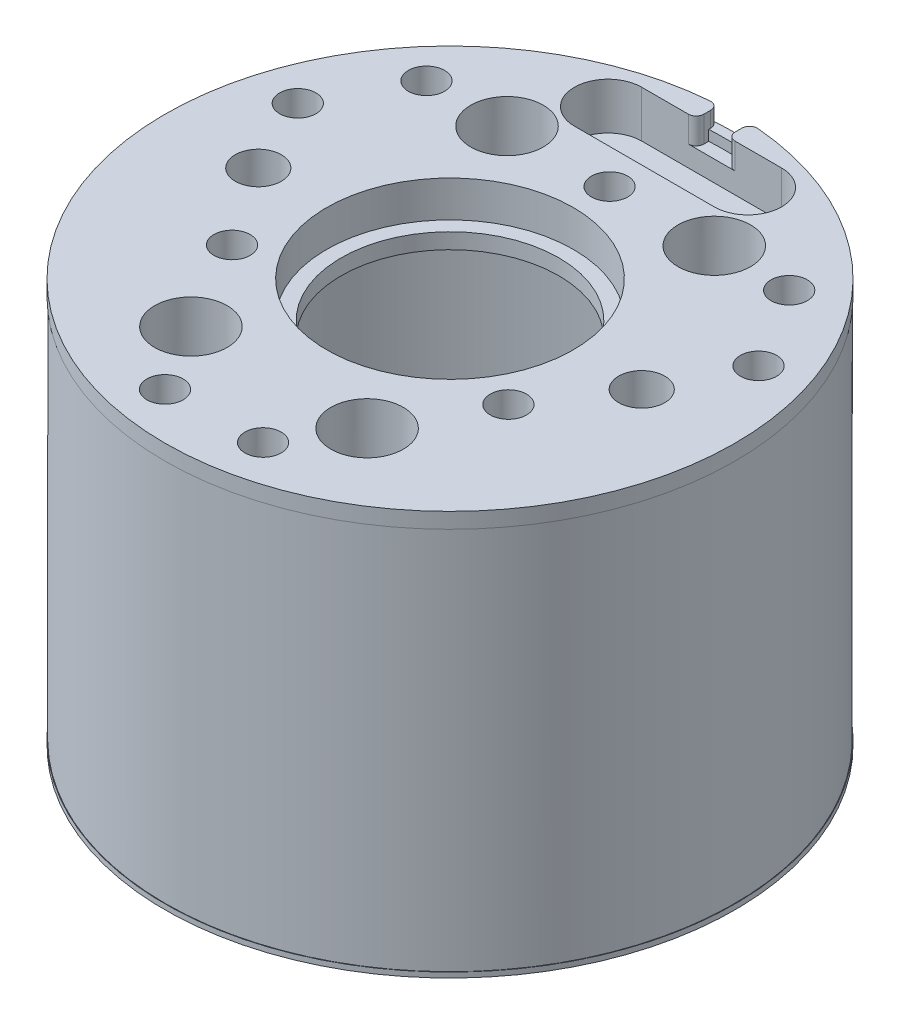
from build123d import *

# Parameters (mm, degrees)
F_2_56_TAPPED_HOLE1_D     = 1.778
CIRPATTERN1_COUNT         = 3
F_4_40_TAPPED_HOLE1_D     = 2.2606
F_4_40_TAPPED_HOLE1_DEPTH = 7.62
F_4_40_TAPPED_HOLE1_TIP   = 0.679152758
SKETCH5_R                 = 1.778
F_4_HOLES_DEPTH           = 28.979227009
SLOT_DEPTH                = 2.286
SKETCH7_W                 = 1.524
SKETCH7_H                 = 1.143
NOTCH_DEPTH               = 1.27
NOTCH_FILLET_R            = 0.381
SKETCH8_W                 = 0.4826
SKETCH8_H                 = 18.796


with BuildPart() as part:
    # Sketch1 → Body (revolve)
    with BuildSketch(Plane.XY, mode=Mode.PRIVATE) as body_sk:
        Polygon((13.208, -2.54), (13.208, -19.812), (13.97, -19.812), (13.97, -19.558), (13.462, -19.558), (13.462, -0.762), (13.97, -0.762), (13.97, 0), (6.0452, 0), (6.0452, -1.778), (5.334, -1.778), (5.334, -2.54), align=None)
    revolve(body_sk.sketch.rotate(Axis((0, 0, 0), (0, 1, 0)), 90), axis=Axis((0, 0, 0), (0, 1, 0)))

    # 2-56 Tapped Hole1 (through all)
    with Locations(Plane(origin=(-6.773820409, 0, 3.910867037), x_dir=(0, 0, 1), z_dir=(0, 1, 0))):
        with Locations((0, 0), (-7.624798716, -4.402179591), (7.773132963, 4.487820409)):
            f_2_56_tapped_hole1 = Hole(F_2_56_TAPPED_HOLE1_D / 2)

    # CirPattern1: 2-56 Tapped Hole1 ×3 about axis
    cirpattern1_axis = Axis((0, 0, 0), (0, 1, 0))
    for i in range(1, CIRPATTERN1_COUNT):
        add(f_2_56_tapped_hole1.rotate(cirpattern1_axis, i * 360 / CIRPATTERN1_COUNT), mode=Mode.SUBTRACT)

    # 4-40 Tapped Hole1
    with Locations(Plane(origin=(-9.398, 0, 0), x_dir=(0, 0, 1), z_dir=(0, 1, 0))):
        with Locations((0, 0), (0, 18.796)):
            Hole(F_4_40_TAPPED_HOLE1_D / 2, depth=F_4_40_TAPPED_HOLE1_DEPTH)
            with Locations((0, 0, -(F_4_40_TAPPED_HOLE1_DEPTH + F_4_40_TAPPED_HOLE1_TIP / 2))):  # 118° drill point
                Cone(0, F_4_40_TAPPED_HOLE1_D / 2, F_4_40_TAPPED_HOLE1_TIP, mode=Mode.SUBTRACT)

    # Sketch5 → 4 Holes (cut, through all)
    with BuildSketch(Plane(origin=(0, 0, 0), x_dir=(1, 0, 0), z_dir=(0, 1, 0))):
        with Locations(Location((-5.08, 7.874, 0), (0, 0, 270))):
            Circle(SKETCH5_R)
        with Locations(Location((5.08, 7.874, 0), (0, 0, 270))):
            Circle(SKETCH5_R)
        with Locations(Location((-4.318, -8.382, 0), (0, 0, 270))):
            Circle(SKETCH5_R)
        with Locations(Location((4.318, -8.382, 0), (0, 0, 270))):
            Circle(SKETCH5_R)
    extrude(amount=-F_4_HOLES_DEPTH, mode=Mode.SUBTRACT)

    # Sketch6 → Slot (cut)
    with BuildSketch(Plane(origin=(0, 0, 0), x_dir=(1, 0, 0), z_dir=(0, 1, 0))):
        with BuildLine():
            Line((-3.429, 12.827), (3.429, 12.827))
            ThreePointArc((3.429, 12.827), (5.08, 11.176), (3.429, 9.525))
            Line((3.429, 9.525), (-3.429, 9.525))
            ThreePointArc((-3.429, 9.525), (-5.08, 11.176), (-3.429, 12.827))
        make_face()
    extrude(amount=-SLOT_DEPTH, mode=Mode.SUBTRACT)

    # Sketch7 → Notch (cut)
    with BuildSketch(Plane(origin=(0, 0, 0), x_dir=(1, 0, 0), z_dir=(0, 1, 0))):
        with Locations((0, 13.3985)):
            Rectangle(SKETCH7_W, SKETCH7_H)
    extrude(amount=-NOTCH_DEPTH, mode=Mode.SUBTRACT)

    # Notch Fillet
    notch_fillet_edges = [part.edges().sort_by_distance(p)[0] for p in [
        (-0.762, -0.381, -13.949202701),
        (0.762, -0.381, -13.949202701),
        (-0.762, -0.635, -12.827),
        (0.762, -0.635, -12.827),
    ]]
    fillet(notch_fillet_edges, radius=NOTCH_FILLET_R)

    # Sketch8 → Coils (revolve)
    with BuildSketch(Plane.XY, mode=Mode.PRIVATE) as coils_sk:
        with Locations((13.7033, -10.16)):
            Rectangle(SKETCH8_W, SKETCH8_H)
    revolve(coils_sk.sketch.rotate(Axis((0, 0, 0), (0, -1, 0)), 90), axis=Axis((0, 0, 0), (0, -1, 0)))


solid = part.part
